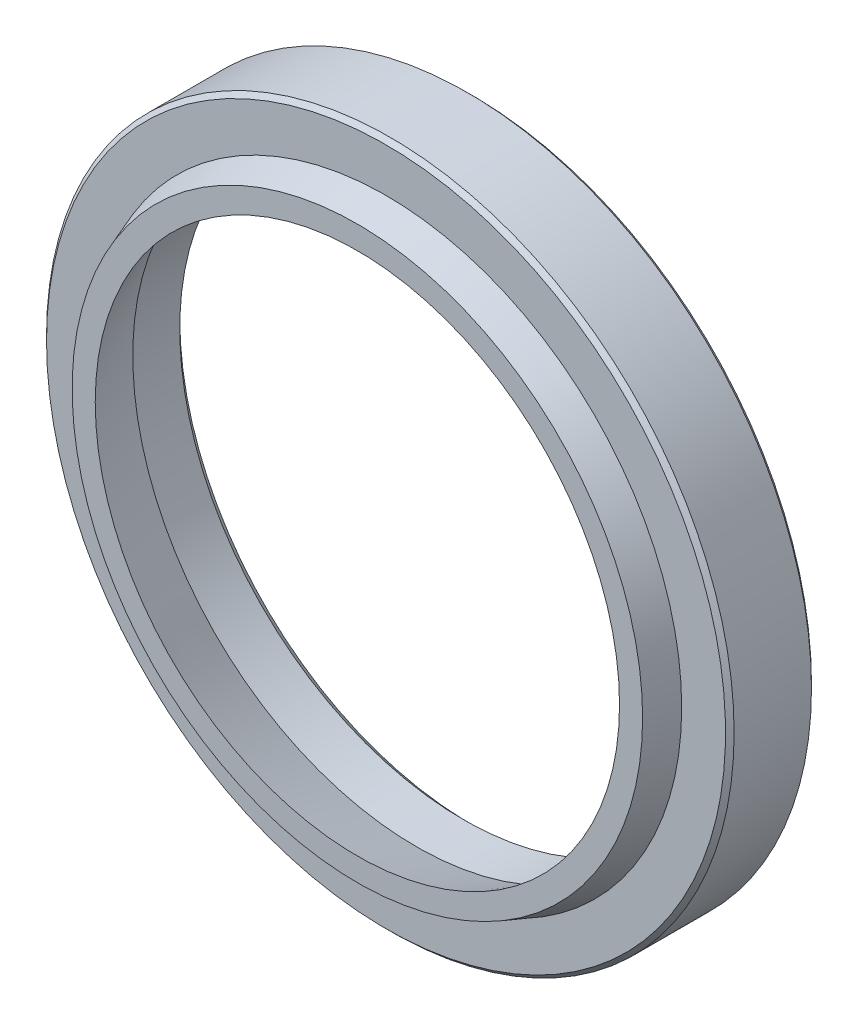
ISO-10303-21;
HEADER;
FILE_DESCRIPTION(('STEP AP214'),'2;1');
FILE_NAME('part.step','',(''),(''),'','','');
FILE_SCHEMA(('AUTOMOTIVE_DESIGN { 1 0 10303 214 1 1 1 1 }'));
ENDSEC;
DATA;
#1=APPLICATION_CONTEXT('core data for automotive mechanical design processes');
#2=APPLICATION_PROTOCOL_DEFINITION('international standard','automotive_design',2000,#1);
#3=PRODUCT_CONTEXT('',#1,'mechanical');
#4=PRODUCT('Part','Part','',(#3));
#5=PRODUCT_RELATED_PRODUCT_CATEGORY('part','',(#4));
#6=PRODUCT_DEFINITION_FORMATION('','',#4);
#7=PRODUCT_DEFINITION_CONTEXT('part definition',#1,'design');
#8=PRODUCT_DEFINITION('design','',#6,#7);
#9=PRODUCT_DEFINITION_SHAPE('','',#8);
#10=(LENGTH_UNIT() NAMED_UNIT(*) SI_UNIT(.MILLI.,.METRE.));
#11=(NAMED_UNIT(*) PLANE_ANGLE_UNIT() SI_UNIT($,.RADIAN.));
#12=(NAMED_UNIT(*) SI_UNIT($,.STERADIAN.) SOLID_ANGLE_UNIT());
#13=UNCERTAINTY_MEASURE_WITH_UNIT(LENGTH_MEASURE(1.E-05),#10,'distance_accuracy_value','');
#14=(GEOMETRIC_REPRESENTATION_CONTEXT(3) GLOBAL_UNCERTAINTY_ASSIGNED_CONTEXT((#13)) GLOBAL_UNIT_ASSIGNED_CONTEXT((#10,
#11,#12)) REPRESENTATION_CONTEXT('',''));
#15=CARTESIAN_POINT('',(0.,0.,0.));
#16=DIRECTION('',(0.,0.,1.));
#17=DIRECTION('',(1.,0.,0.));
#18=AXIS2_PLACEMENT_3D('',#15,#16,#17);
#19=CARTESIAN_POINT('',(-16.5,0.,-6.66666666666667));
#20=DIRECTION('',(0.,0.,1.));
#21=DIRECTION('',(1.,0.,0.));
#22=AXIS2_PLACEMENT_3D('',#19,#20,#21);
#23=PLANE('',#22);
#24=CARTESIAN_POINT('',(0.,0.,-6.66666666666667));
#25=DIRECTION('',(0.,0.,1.));
#26=DIRECTION('',(1.,0.,0.));
#27=AXIS2_PLACEMENT_3D('',#24,#25,#26);
#28=CIRCLE('',#27,19.75);
#29=CARTESIAN_POINT('',(19.75,0.,-6.66666666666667));
#30=VERTEX_POINT('',#29);
#31=EDGE_CURVE('E10',#30,#30,#28,.F.);
#32=ORIENTED_EDGE('',*,*,#31,.T.);
#33=EDGE_LOOP('',(#32));
#34=FACE_BOUND('',#33,.T.);
#35=CARTESIAN_POINT('',(0.,0.,-6.66666666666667));
#36=DIRECTION('',(0.,0.,1.));
#37=DIRECTION('',(1.,0.,0.));
#38=AXIS2_PLACEMENT_3D('',#35,#36,#37);
#39=CIRCLE('',#38,17.);
#40=CARTESIAN_POINT('',(17.,0.,-6.66666666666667));
#41=VERTEX_POINT('',#40);
#42=EDGE_CURVE('E54',#41,#41,#39,.T.);
#43=ORIENTED_EDGE('',*,*,#42,.T.);
#44=EDGE_LOOP('',(#43));
#45=FACE_BOUND('',#44,.T.);
#46=ADVANCED_FACE('F31',(#34,#45),#23,.F.);
#47=CARTESIAN_POINT('',(0.,0.,9.19589868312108));
#48=DIRECTION('',(0.,0.,1.));
#49=DIRECTION('',(1.,0.,0.));
#50=AXIS2_PLACEMENT_3D('',#47,#48,#49);
#51=CYLINDRICAL_SURFACE('',#50,20.);
#52=CARTESIAN_POINT('',(0.,0.,-1.91666666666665));
#53=DIRECTION('',(0.,0.,-1.));
#54=DIRECTION('',(-1.,0.,0.));
#55=AXIS2_PLACEMENT_3D('',#52,#53,#54);
#56=CIRCLE('',#55,20.);
#57=CARTESIAN_POINT('',(-20.,0.,-1.91666666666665));
#58=VERTEX_POINT('',#57);
#59=EDGE_CURVE('E38',#58,#58,#56,.T.);
#60=ORIENTED_EDGE('',*,*,#59,.T.);
#61=EDGE_LOOP('',(#60));
#62=FACE_BOUND('',#61,.T.);
#63=CARTESIAN_POINT('',(0.,0.,-6.41666666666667));
#64=DIRECTION('',(0.,0.,1.));
#65=DIRECTION('',(1.,0.,0.));
#66=AXIS2_PLACEMENT_3D('',#63,#64,#65);
#67=CIRCLE('',#66,20.);
#68=CARTESIAN_POINT('',(20.,0.,-6.41666666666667));
#69=VERTEX_POINT('',#68);
#70=EDGE_CURVE('E42',#69,#69,#67,.T.);
#71=ORIENTED_EDGE('',*,*,#70,.T.);
#72=EDGE_LOOP('',(#71));
#73=FACE_BOUND('',#72,.T.);
#74=ADVANCED_FACE('F92',(#62,#73),#51,.T.);
#75=CARTESIAN_POINT('',(-17.2,0.,-1.66666666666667));
#76=DIRECTION('',(0.,0.,-1.));
#77=DIRECTION('',(-1.,0.,0.));
#78=AXIS2_PLACEMENT_3D('',#75,#76,#77);
#79=PLANE('',#78);
#80=CARTESIAN_POINT('',(0.,0.,-1.66666666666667));
#81=DIRECTION('',(0.,0.,-1.));
#82=DIRECTION('',(-1.,0.,0.));
#83=AXIS2_PLACEMENT_3D('',#80,#81,#82);
#84=CIRCLE('',#83,19.75);
#85=CARTESIAN_POINT('',(-19.75,0.,-1.66666666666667));
#86=VERTEX_POINT('',#85);
#87=EDGE_CURVE('E46',#86,#86,#84,.F.);
#88=ORIENTED_EDGE('',*,*,#87,.T.);
#89=EDGE_LOOP('',(#88));
#90=FACE_BOUND('',#89,.T.);
#91=CARTESIAN_POINT('',(0.,0.,-1.66666666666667));
#92=DIRECTION('',(0.,0.,1.));
#93=DIRECTION('',(1.,0.,0.));
#94=AXIS2_PLACEMENT_3D('',#91,#92,#93);
#95=CIRCLE('',#94,17.2);
#96=CARTESIAN_POINT('',(17.2,0.,-1.66666666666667));
#97=VERTEX_POINT('',#96);
#98=EDGE_CURVE('E57',#97,#97,#95,.T.);
#99=ORIENTED_EDGE('',*,*,#98,.F.);
#100=EDGE_LOOP('',(#99));
#101=FACE_BOUND('',#100,.T.);
#102=ADVANCED_FACE('F87',(#90,#101),#79,.F.);
#103=CARTESIAN_POINT('',(0.,0.,-1.66666666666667));
#104=DIRECTION('',(0.,0.,-1.));
#105=DIRECTION('',(-1.,0.,0.));
#106=AXIS2_PLACEMENT_3D('',#103,#104,#105);
#107=CONICAL_SURFACE('',#106,17.2,0.349065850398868);
#108=CARTESIAN_POINT('',(0.,0.,0.));
#109=DIRECTION('',(0.,0.,1.));
#110=DIRECTION('',(1.,0.,0.));
#111=AXIS2_PLACEMENT_3D('',#108,#109,#110);
#112=CIRCLE('',#111,16.5933829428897);
#113=CARTESIAN_POINT('',(16.5933829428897,0.,0.));
#114=VERTEX_POINT('',#113);
#115=EDGE_CURVE('E60',#114,#114,#112,.T.);
#116=ORIENTED_EDGE('',*,*,#115,.F.);
#117=EDGE_LOOP('',(#116));
#118=FACE_BOUND('',#117,.T.);
#119=ORIENTED_EDGE('',*,*,#98,.T.);
#120=EDGE_LOOP('',(#119));
#121=FACE_BOUND('',#120,.T.);
#122=ADVANCED_FACE('F81',(#118,#121),#107,.T.);
#123=CARTESIAN_POINT('',(-15.25,0.,0.));
#124=DIRECTION('',(0.,0.,-1.));
#125=DIRECTION('',(-1.,0.,0.));
#126=AXIS2_PLACEMENT_3D('',#123,#124,#125);
#127=PLANE('',#126);
#128=CARTESIAN_POINT('',(0.,0.,0.));
#129=DIRECTION('',(0.,0.,1.));
#130=DIRECTION('',(1.,0.,0.));
#131=AXIS2_PLACEMENT_3D('',#128,#129,#130);
#132=CIRCLE('',#131,15.25);
#133=CARTESIAN_POINT('',(15.25,0.,0.));
#134=VERTEX_POINT('',#133);
#135=EDGE_CURVE('E63',#134,#134,#132,.T.);
#136=ORIENTED_EDGE('',*,*,#135,.F.);
#137=EDGE_LOOP('',(#136));
#138=FACE_BOUND('',#137,.T.);
#139=ORIENTED_EDGE('',*,*,#115,.T.);
#140=EDGE_LOOP('',(#139));
#141=FACE_BOUND('',#140,.T.);
#142=ADVANCED_FACE('F75',(#138,#141),#127,.F.);
#143=CARTESIAN_POINT('',(0.,0.,0.));
#144=DIRECTION('',(0.,0.,-1.));
#145=DIRECTION('',(-1.,0.,0.));
#146=AXIS2_PLACEMENT_3D('',#143,#144,#145);
#147=CONICAL_SURFACE('',#146,15.25,0.349065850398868);
#148=CARTESIAN_POINT('',(0.,0.,-3.43434677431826));
#149=DIRECTION('',(0.,0.,1.));
#150=DIRECTION('',(1.,0.,0.));
#151=AXIS2_PLACEMENT_3D('',#148,#149,#150);
#152=CIRCLE('',#151,16.5);
#153=CARTESIAN_POINT('',(16.5,0.,-3.43434677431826));
#154=VERTEX_POINT('',#153);
#155=EDGE_CURVE('E66',#154,#154,#152,.T.);
#156=ORIENTED_EDGE('',*,*,#155,.F.);
#157=EDGE_LOOP('',(#156));
#158=FACE_BOUND('',#157,.T.);
#159=ORIENTED_EDGE('',*,*,#135,.T.);
#160=EDGE_LOOP('',(#159));
#161=FACE_BOUND('',#160,.T.);
#162=ADVANCED_FACE('F72',(#158,#161),#147,.F.);
#163=CARTESIAN_POINT('',(0.,0.,9.19589868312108));
#164=DIRECTION('',(0.,0.,1.));
#165=DIRECTION('',(1.,0.,0.));
#166=AXIS2_PLACEMENT_3D('',#163,#164,#165);
#167=CYLINDRICAL_SURFACE('',#166,16.5);
#168=CARTESIAN_POINT('',(0.,0.,-6.16666666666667));
#169=DIRECTION('',(0.,0.,1.));
#170=DIRECTION('',(1.,0.,0.));
#171=AXIS2_PLACEMENT_3D('',#168,#169,#170);
#172=CIRCLE('',#171,16.5);
#173=CARTESIAN_POINT('',(16.5,0.,-6.16666666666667));
#174=VERTEX_POINT('',#173);
#175=EDGE_CURVE('E51',#174,#174,#172,.F.);
#176=ORIENTED_EDGE('',*,*,#175,.T.);
#177=EDGE_LOOP('',(#176));
#178=FACE_BOUND('',#177,.T.);
#179=ORIENTED_EDGE('',*,*,#155,.T.);
#180=EDGE_LOOP('',(#179));
#181=FACE_BOUND('',#180,.T.);
#182=ADVANCED_FACE('F70',(#178,#181),#167,.F.);
#183=CARTESIAN_POINT('',(0.,0.,-6.66666666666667));
#184=DIRECTION('',(0.,0.,-1.));
#185=DIRECTION('',(-1.,0.,0.));
#186=AXIS2_PLACEMENT_3D('',#183,#184,#185);
#187=CONICAL_SURFACE('',#186,17.,0.785398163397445);
#188=ORIENTED_EDGE('',*,*,#175,.F.);
#189=EDGE_LOOP('',(#188));
#190=FACE_BOUND('',#189,.T.);
#191=ORIENTED_EDGE('',*,*,#42,.F.);
#192=EDGE_LOOP('',(#191));
#193=FACE_BOUND('',#192,.T.);
#194=ADVANCED_FACE('F105',(#190,#193),#187,.F.);
#195=CARTESIAN_POINT('',(0.,0.,-1.66666666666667));
#196=DIRECTION('',(0.,0.,-1.));
#197=DIRECTION('',(-1.,0.,0.));
#198=AXIS2_PLACEMENT_3D('',#195,#196,#197);
#199=CONICAL_SURFACE('',#198,19.75,0.785398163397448);
#200=ORIENTED_EDGE('',*,*,#59,.F.);
#201=EDGE_LOOP('',(#200));
#202=FACE_BOUND('',#201,.T.);
#203=ORIENTED_EDGE('',*,*,#87,.F.);
#204=EDGE_LOOP('',(#203));
#205=FACE_BOUND('',#204,.T.);
#206=ADVANCED_FACE('F107',(#202,#205),#199,.T.);
#207=CARTESIAN_POINT('',(0.,0.,-6.41666666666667));
#208=DIRECTION('',(0.,0.,1.));
#209=DIRECTION('',(1.,0.,0.));
#210=AXIS2_PLACEMENT_3D('',#207,#208,#209);
#211=CONICAL_SURFACE('',#210,20.,0.785398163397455);
#212=ORIENTED_EDGE('',*,*,#31,.F.);
#213=EDGE_LOOP('',(#212));
#214=FACE_BOUND('',#213,.T.);
#215=ORIENTED_EDGE('',*,*,#70,.F.);
#216=EDGE_LOOP('',(#215));
#217=FACE_BOUND('',#216,.T.);
#218=ADVANCED_FACE('F33',(#214,#217),#211,.T.);
#219=CLOSED_SHELL('',(#46,#74,#102,#122,#142,#162,#182,#194,#206,#218));
#220=MANIFOLD_SOLID_BREP('B2',#219);
#221=ADVANCED_BREP_SHAPE_REPRESENTATION('',(#18,#220),#14);
#222=SHAPE_DEFINITION_REPRESENTATION(#9,#221);
ENDSEC;
END-ISO-10303-21;
